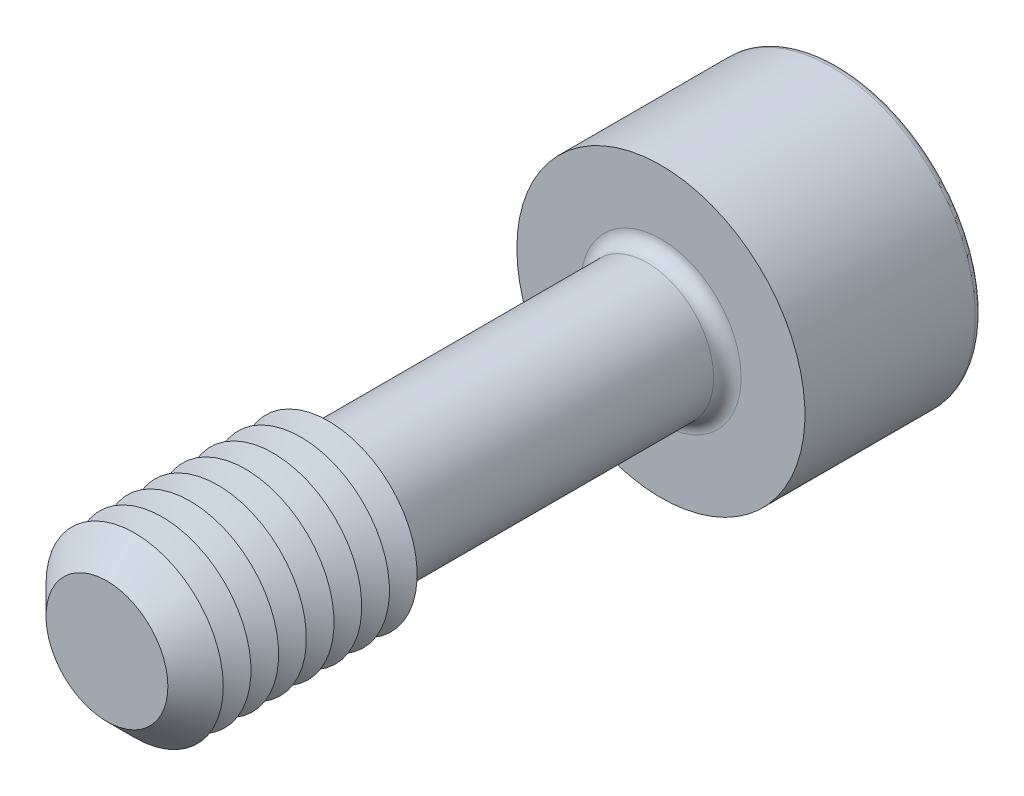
ISO-10303-21;
HEADER;
FILE_DESCRIPTION(('STEP AP214'),'2;1');
FILE_NAME('part.step','',(''),(''),'','','');
FILE_SCHEMA(('AUTOMOTIVE_DESIGN { 1 0 10303 214 1 1 1 1 }'));
ENDSEC;
DATA;
#1=APPLICATION_CONTEXT('core data for automotive mechanical design processes');
#2=APPLICATION_PROTOCOL_DEFINITION('international standard','automotive_design',2000,#1);
#3=PRODUCT_CONTEXT('',#1,'mechanical');
#4=PRODUCT('Part','Part','',(#3));
#5=PRODUCT_RELATED_PRODUCT_CATEGORY('part','',(#4));
#6=PRODUCT_DEFINITION_FORMATION('','',#4);
#7=PRODUCT_DEFINITION_CONTEXT('part definition',#1,'design');
#8=PRODUCT_DEFINITION('design','',#6,#7);
#9=PRODUCT_DEFINITION_SHAPE('','',#8);
#10=(LENGTH_UNIT() NAMED_UNIT(*) SI_UNIT(.MILLI.,.METRE.));
#11=(NAMED_UNIT(*) PLANE_ANGLE_UNIT() SI_UNIT($,.RADIAN.));
#12=(NAMED_UNIT(*) SI_UNIT($,.STERADIAN.) SOLID_ANGLE_UNIT());
#13=UNCERTAINTY_MEASURE_WITH_UNIT(LENGTH_MEASURE(1.E-05),#10,'distance_accuracy_value','');
#14=(GEOMETRIC_REPRESENTATION_CONTEXT(3) GLOBAL_UNCERTAINTY_ASSIGNED_CONTEXT((#13)) GLOBAL_UNIT_ASSIGNED_CONTEXT((#10,
#11,#12)) REPRESENTATION_CONTEXT('',''));
#15=CARTESIAN_POINT('',(0.,0.,0.));
#16=DIRECTION('',(0.,0.,1.));
#17=DIRECTION('',(1.,0.,0.));
#18=AXIS2_PLACEMENT_3D('',#15,#16,#17);
#19=CARTESIAN_POINT('',(-1.73205080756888,-3.,-14.5));
#20=DIRECTION('',(0.,0.,1.));
#21=DIRECTION('',(1.,0.,0.));
#22=AXIS2_PLACEMENT_3D('',#19,#20,#21);
#23=PLANE('',#22);
#24=DIRECTION('',(1.,0.,0.));
#25=VECTOR('',#24,1.);
#26=CARTESIAN_POINT('',(-1.73205080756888,-3.,-14.5));
#27=LINE('',#26,#25);
#28=CARTESIAN_POINT('',(0.,-3.,-14.5));
#29=VERTEX_POINT('',#28);
#30=CARTESIAN_POINT('',(1.73205080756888,-3.,-14.5));
#31=VERTEX_POINT('',#30);
#32=EDGE_CURVE('E405',#29,#31,#27,.T.);
#33=ORIENTED_EDGE('',*,*,#32,.F.);
#34=CARTESIAN_POINT('',(0.,0.,-14.5));
#35=DIRECTION('',(0.,0.,1.));
#36=DIRECTION('',(0.,-1.,0.));
#37=AXIS2_PLACEMENT_3D('',#34,#35,#36);
#38=CIRCLE('',#37,3.);
#39=CARTESIAN_POINT('',(2.59807621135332,-1.5,-14.5));
#40=VERTEX_POINT('',#39);
#41=EDGE_CURVE('E53',#29,#40,#38,.T.);
#42=ORIENTED_EDGE('',*,*,#41,.T.);
#43=DIRECTION('',(0.5,0.866025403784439,0.));
#44=VECTOR('',#43,1.);
#45=CARTESIAN_POINT('',(1.73205080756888,-3.,-14.5));
#46=LINE('',#45,#44);
#47=EDGE_CURVE('E394',#31,#40,#46,.T.);
#48=ORIENTED_EDGE('',*,*,#47,.F.);
#49=EDGE_LOOP('',(#33,#42,#48));
#50=FACE_BOUND('',#49,.T.);
#51=ADVANCED_FACE('F41',(#50),#23,.F.);
#52=CARTESIAN_POINT('',(3.46410161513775,0.,-14.5));
#53=VERTEX_POINT('',#52);
#54=EDGE_CURVE('E399',#40,#53,#46,.T.);
#55=ORIENTED_EDGE('',*,*,#54,.F.);
#56=CARTESIAN_POINT('',(2.59807621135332,1.5,-14.5));
#57=VERTEX_POINT('',#56);
#58=EDGE_CURVE('E11',#40,#57,#38,.T.);
#59=ORIENTED_EDGE('',*,*,#58,.T.);
#60=DIRECTION('',(-0.5,0.866025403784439,0.));
#61=VECTOR('',#60,1.);
#62=CARTESIAN_POINT('',(3.46410161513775,0.,-14.5));
#63=LINE('',#62,#61);
#64=EDGE_CURVE('E391',#53,#57,#63,.T.);
#65=ORIENTED_EDGE('',*,*,#64,.F.);
#66=EDGE_LOOP('',(#55,#59,#65));
#67=FACE_BOUND('',#66,.T.);
#68=ADVANCED_FACE('F133',(#67),#23,.F.);
#69=CARTESIAN_POINT('',(1.73205080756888,3.,-14.5));
#70=VERTEX_POINT('',#69);
#71=EDGE_CURVE('E390',#57,#70,#63,.T.);
#72=ORIENTED_EDGE('',*,*,#71,.F.);
#73=CARTESIAN_POINT('',(0.,3.,-14.5));
#74=VERTEX_POINT('',#73);
#75=EDGE_CURVE('E51',#57,#74,#38,.T.);
#76=ORIENTED_EDGE('',*,*,#75,.T.);
#77=DIRECTION('',(-1.,0.,0.));
#78=VECTOR('',#77,1.);
#79=CARTESIAN_POINT('',(1.73205080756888,3.,-14.5));
#80=LINE('',#79,#78);
#81=EDGE_CURVE('E177',#70,#74,#80,.T.);
#82=ORIENTED_EDGE('',*,*,#81,.F.);
#83=EDGE_LOOP('',(#72,#76,#82));
#84=FACE_BOUND('',#83,.T.);
#85=ADVANCED_FACE('F139',(#84),#23,.F.);
#86=CARTESIAN_POINT('',(-1.73205080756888,3.,-14.5));
#87=VERTEX_POINT('',#86);
#88=EDGE_CURVE('E396',#74,#87,#80,.T.);
#89=ORIENTED_EDGE('',*,*,#88,.F.);
#90=CARTESIAN_POINT('',(-2.59807621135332,1.5,-14.5));
#91=VERTEX_POINT('',#90);
#92=EDGE_CURVE('E265',#74,#91,#38,.T.);
#93=ORIENTED_EDGE('',*,*,#92,.T.);
#94=DIRECTION('',(-0.5,-0.866025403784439,0.));
#95=VECTOR('',#94,1.);
#96=CARTESIAN_POINT('',(-1.73205080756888,3.,-14.5));
#97=LINE('',#96,#95);
#98=EDGE_CURVE('E176',#87,#91,#97,.T.);
#99=ORIENTED_EDGE('',*,*,#98,.F.);
#100=EDGE_LOOP('',(#89,#93,#99));
#101=FACE_BOUND('',#100,.T.);
#102=ADVANCED_FACE('F157',(#101),#23,.F.);
#103=CARTESIAN_POINT('',(-3.46410161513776,0.,-14.5));
#104=VERTEX_POINT('',#103);
#105=EDGE_CURVE('E170',#91,#104,#97,.T.);
#106=ORIENTED_EDGE('',*,*,#105,.F.);
#107=CARTESIAN_POINT('',(-2.59807621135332,-1.5,-14.5));
#108=VERTEX_POINT('',#107);
#109=EDGE_CURVE('E172',#91,#108,#38,.T.);
#110=ORIENTED_EDGE('',*,*,#109,.T.);
#111=DIRECTION('',(0.5,-0.866025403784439,0.));
#112=VECTOR('',#111,1.);
#113=CARTESIAN_POINT('',(-3.46410161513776,0.,-14.5));
#114=LINE('',#113,#112);
#115=EDGE_CURVE('E174',#104,#108,#114,.T.);
#116=ORIENTED_EDGE('',*,*,#115,.F.);
#117=EDGE_LOOP('',(#106,#110,#116));
#118=FACE_BOUND('',#117,.T.);
#119=ADVANCED_FACE('F146',(#118),#23,.F.);
#120=CARTESIAN_POINT('',(0.,0.,-20.5));
#121=DIRECTION('',(0.,0.,-1.));
#122=DIRECTION('',(-1.,0.,0.));
#123=AXIS2_PLACEMENT_3D('',#120,#121,#122);
#124=PLANE('',#123);
#125=CARTESIAN_POINT('',(0.,0.,-20.5));
#126=DIRECTION('',(0.,0.,-1.));
#127=DIRECTION('',(-1.,0.,0.));
#128=AXIS2_PLACEMENT_3D('',#125,#126,#127);
#129=CIRCLE('',#128,6.19);
#130=CARTESIAN_POINT('',(-6.19,0.,-20.5));
#131=VERTEX_POINT('',#130);
#132=EDGE_CURVE('E250',#131,#131,#129,.T.);
#133=ORIENTED_EDGE('',*,*,#132,.T.);
#134=EDGE_LOOP('',(#133));
#135=FACE_BOUND('',#134,.T.);
#136=DIRECTION('',(-0.5,-0.866025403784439,0.));
#137=VECTOR('',#136,1.);
#138=CARTESIAN_POINT('',(-1.73205080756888,3.,-20.5));
#139=LINE('',#138,#137);
#140=CARTESIAN_POINT('',(-1.73205080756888,3.,-20.5));
#141=VERTEX_POINT('',#140);
#142=CARTESIAN_POINT('',(-3.46410161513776,0.,-20.5));
#143=VERTEX_POINT('',#142);
#144=EDGE_CURVE('E212',#141,#143,#139,.T.);
#145=ORIENTED_EDGE('',*,*,#144,.T.);
#146=DIRECTION('',(0.5,-0.866025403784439,0.));
#147=VECTOR('',#146,1.);
#148=CARTESIAN_POINT('',(-3.46410161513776,0.,-20.5));
#149=LINE('',#148,#147);
#150=CARTESIAN_POINT('',(-1.73205080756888,-3.,-20.5));
#151=VERTEX_POINT('',#150);
#152=EDGE_CURVE('E67',#143,#151,#149,.T.);
#153=ORIENTED_EDGE('',*,*,#152,.T.);
#154=DIRECTION('',(1.,0.,0.));
#155=VECTOR('',#154,1.);
#156=CARTESIAN_POINT('',(-1.73205080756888,-3.,-20.5));
#157=LINE('',#156,#155);
#158=CARTESIAN_POINT('',(1.73205080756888,-3.,-20.5));
#159=VERTEX_POINT('',#158);
#160=EDGE_CURVE('E196',#151,#159,#157,.T.);
#161=ORIENTED_EDGE('',*,*,#160,.T.);
#162=DIRECTION('',(0.5,0.866025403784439,0.));
#163=VECTOR('',#162,1.);
#164=CARTESIAN_POINT('',(1.73205080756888,-3.,-20.5));
#165=LINE('',#164,#163);
#166=CARTESIAN_POINT('',(3.46410161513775,0.,-20.5));
#167=VERTEX_POINT('',#166);
#168=EDGE_CURVE('E200',#159,#167,#165,.T.);
#169=ORIENTED_EDGE('',*,*,#168,.T.);
#170=DIRECTION('',(-0.5,0.866025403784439,0.));
#171=VECTOR('',#170,1.);
#172=CARTESIAN_POINT('',(3.46410161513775,0.,-20.5));
#173=LINE('',#172,#171);
#174=CARTESIAN_POINT('',(1.73205080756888,3.,-20.5));
#175=VERTEX_POINT('',#174);
#176=EDGE_CURVE('E204',#167,#175,#173,.T.);
#177=ORIENTED_EDGE('',*,*,#176,.T.);
#178=DIRECTION('',(-1.,0.,0.));
#179=VECTOR('',#178,1.);
#180=CARTESIAN_POINT('',(1.73205080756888,3.,-20.5));
#181=LINE('',#180,#179);
#182=EDGE_CURVE('E208',#175,#141,#181,.T.);
#183=ORIENTED_EDGE('',*,*,#182,.T.);
#184=EDGE_LOOP('',(#145,#153,#161,#169,#177,#183));
#185=FACE_BOUND('',#184,.T.);
#186=ADVANCED_FACE('F156',(#135,#185),#124,.T.);
#187=CARTESIAN_POINT('',(0.,0.,12.5));
#188=DIRECTION('',(0.,0.,-1.));
#189=DIRECTION('',(-1.,0.,0.));
#190=AXIS2_PLACEMENT_3D('',#187,#188,#189);
#191=CYLINDRICAL_SURFACE('',#190,3.);
#192=CARTESIAN_POINT('',(0.,0.,-11.88));
#193=DIRECTION('',(0.,0.,-1.));
#194=DIRECTION('',(-1.,0.,0.));
#195=AXIS2_PLACEMENT_3D('',#192,#193,#194);
#196=CIRCLE('',#195,3.);
#197=CARTESIAN_POINT('',(-3.,0.,-11.88));
#198=VERTEX_POINT('',#197);
#199=EDGE_CURVE('E247',#198,#198,#196,.F.);
#200=ORIENTED_EDGE('',*,*,#199,.T.);
#201=EDGE_LOOP('',(#200));
#202=FACE_BOUND('',#201,.T.);
#203=CARTESIAN_POINT('',(0.,0.,1.92264973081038));
#204=DIRECTION('',(0.,0.,-1.));
#205=DIRECTION('',(0.,1.,0.));
#206=AXIS2_PLACEMENT_3D('',#203,#204,#205);
#207=CIRCLE('',#206,3.);
#208=CARTESIAN_POINT('',(0.,3.,1.92264973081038));
#209=VERTEX_POINT('',#208);
#210=EDGE_CURVE('E235',#209,#209,#207,.T.);
#211=ORIENTED_EDGE('',*,*,#210,.T.);
#212=EDGE_LOOP('',(#211));
#213=FACE_BOUND('',#212,.T.);
#214=ADVANCED_FACE('F163',(#202,#213),#191,.T.);
#215=CARTESIAN_POINT('',(0.,0.,1.92264973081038));
#216=DIRECTION('',(0.,0.,1.));
#217=DIRECTION('',(0.,-1.,0.));
#218=AXIS2_PLACEMENT_3D('',#215,#216,#217);
#219=CONICAL_SURFACE('',#218,3.,1.0471975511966);
#220=CARTESIAN_POINT('',(0.,0.,2.5));
#221=DIRECTION('',(0.,0.,-1.));
#222=DIRECTION('',(-1.,0.,0.));
#223=AXIS2_PLACEMENT_3D('',#220,#221,#222);
#224=CIRCLE('',#223,4.);
#225=CARTESIAN_POINT('',(-4.,0.,2.5));
#226=VERTEX_POINT('',#225);
#227=EDGE_CURVE('E269',#226,#226,#224,.T.);
#228=ORIENTED_EDGE('',*,*,#227,.T.);
#229=EDGE_LOOP('',(#228));
#230=FACE_BOUND('',#229,.T.);
#231=ORIENTED_EDGE('',*,*,#210,.F.);
#232=EDGE_LOOP('',(#231));
#233=FACE_BOUND('',#232,.T.);
#234=ADVANCED_FACE('F348',(#230,#233),#219,.T.);
#235=CARTESIAN_POINT('',(0.,0.,-12.5));
#236=DIRECTION('',(0.,0.,-1.));
#237=DIRECTION('',(-1.,0.,0.));
#238=AXIS2_PLACEMENT_3D('',#235,#236,#237);
#239=PLANE('',#238);
#240=CARTESIAN_POINT('',(0.,0.,-12.5));
#241=DIRECTION('',(0.,0.,-1.));
#242=DIRECTION('',(-1.,0.,0.));
#243=AXIS2_PLACEMENT_3D('',#240,#241,#242);
#244=CIRCLE('',#243,3.62);
#245=CARTESIAN_POINT('',(-3.62,0.,-12.5));
#246=VERTEX_POINT('',#245);
#247=EDGE_CURVE('E243',#246,#246,#244,.T.);
#248=ORIENTED_EDGE('',*,*,#247,.T.);
#249=EDGE_LOOP('',(#248));
#250=FACE_BOUND('',#249,.T.);
#251=CARTESIAN_POINT('',(0.,0.,-12.5));
#252=DIRECTION('',(0.,0.,-1.));
#253=DIRECTION('',(-1.,0.,0.));
#254=AXIS2_PLACEMENT_3D('',#251,#252,#253);
#255=CIRCLE('',#254,6.5);
#256=CARTESIAN_POINT('',(-6.5,0.,-12.5));
#257=VERTEX_POINT('',#256);
#258=EDGE_CURVE('E231',#257,#257,#255,.T.);
#259=ORIENTED_EDGE('',*,*,#258,.F.);
#260=EDGE_LOOP('',(#259));
#261=FACE_BOUND('',#260,.T.);
#262=ADVANCED_FACE('F353',(#250,#261),#239,.F.);
#263=CARTESIAN_POINT('',(0.,0.,-20.5));
#264=DIRECTION('',(0.,0.,1.));
#265=DIRECTION('',(1.,0.,0.));
#266=AXIS2_PLACEMENT_3D('',#263,#264,#265);
#267=CYLINDRICAL_SURFACE('',#266,6.5);
#268=CARTESIAN_POINT('',(0.,0.,-20.19));
#269=DIRECTION('',(0.,0.,-1.));
#270=DIRECTION('',(-1.,0.,0.));
#271=AXIS2_PLACEMENT_3D('',#268,#269,#270);
#272=CIRCLE('',#271,6.5);
#273=CARTESIAN_POINT('',(-6.5,0.,-20.19));
#274=VERTEX_POINT('',#273);
#275=EDGE_CURVE('E45',#274,#274,#272,.F.);
#276=ORIENTED_EDGE('',*,*,#275,.T.);
#277=EDGE_LOOP('',(#276));
#278=FACE_BOUND('',#277,.T.);
#279=ORIENTED_EDGE('',*,*,#258,.T.);
#280=EDGE_LOOP('',(#279));
#281=FACE_BOUND('',#280,.T.);
#282=ADVANCED_FACE('F354',(#278,#281),#267,.T.);
#283=CARTESIAN_POINT('',(-3.46410161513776,0.,-14.5));
#284=DIRECTION('',(0.866025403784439,0.5,0.));
#285=DIRECTION('',(-0.5,0.866025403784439,0.));
#286=AXIS2_PLACEMENT_3D('',#283,#284,#285);
#287=PLANE('',#286);
#288=ORIENTED_EDGE('',*,*,#152,.F.);
#289=DIRECTION('',(0.,0.,-1.));
#290=VECTOR('',#289,1.);
#291=CARTESIAN_POINT('',(-3.46410161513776,0.,-14.5));
#292=LINE('',#291,#290);
#293=EDGE_CURVE('E186',#104,#143,#292,.T.);
#294=ORIENTED_EDGE('',*,*,#293,.F.);
#295=ORIENTED_EDGE('',*,*,#115,.T.);
#296=CARTESIAN_POINT('',(-1.73205080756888,-3.,-14.5));
#297=VERTEX_POINT('',#296);
#298=EDGE_CURVE('E215',#108,#297,#114,.T.);
#299=ORIENTED_EDGE('',*,*,#298,.T.);
#300=DIRECTION('',(0.,0.,-1.));
#301=VECTOR('',#300,1.);
#302=CARTESIAN_POINT('',(-1.73205080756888,-3.,-14.5));
#303=LINE('',#302,#301);
#304=EDGE_CURVE('E228',#297,#151,#303,.T.);
#305=ORIENTED_EDGE('',*,*,#304,.T.);
#306=EDGE_LOOP('',(#288,#294,#295,#299,#305));
#307=FACE_BOUND('',#306,.T.);
#308=ADVANCED_FACE('F357',(#307),#287,.T.);
#309=CARTESIAN_POINT('',(-1.73205080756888,-3.,-14.5));
#310=DIRECTION('',(0.,1.,0.));
#311=DIRECTION('',(0.,0.,1.));
#312=AXIS2_PLACEMENT_3D('',#309,#310,#311);
#313=PLANE('',#312);
#314=ORIENTED_EDGE('',*,*,#160,.F.);
#315=ORIENTED_EDGE('',*,*,#304,.F.);
#316=EDGE_CURVE('E402',#297,#29,#27,.T.);
#317=ORIENTED_EDGE('',*,*,#316,.T.);
#318=ORIENTED_EDGE('',*,*,#32,.T.);
#319=DIRECTION('',(0.,0.,-1.));
#320=VECTOR('',#319,1.);
#321=CARTESIAN_POINT('',(1.73205080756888,-3.,-14.5));
#322=LINE('',#321,#320);
#323=EDGE_CURVE('E225',#31,#159,#322,.T.);
#324=ORIENTED_EDGE('',*,*,#323,.T.);
#325=EDGE_LOOP('',(#314,#315,#317,#318,#324));
#326=FACE_BOUND('',#325,.T.);
#327=ADVANCED_FACE('F363',(#326),#313,.T.);
#328=CARTESIAN_POINT('',(1.73205080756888,-3.,-14.5));
#329=DIRECTION('',(-0.866025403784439,0.5,0.));
#330=DIRECTION('',(-0.5,-0.866025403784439,0.));
#331=AXIS2_PLACEMENT_3D('',#328,#329,#330);
#332=PLANE('',#331);
#333=ORIENTED_EDGE('',*,*,#168,.F.);
#334=ORIENTED_EDGE('',*,*,#323,.F.);
#335=ORIENTED_EDGE('',*,*,#47,.T.);
#336=ORIENTED_EDGE('',*,*,#54,.T.);
#337=DIRECTION('',(0.,0.,-1.));
#338=VECTOR('',#337,1.);
#339=CARTESIAN_POINT('',(3.46410161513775,0.,-14.5));
#340=LINE('',#339,#338);
#341=EDGE_CURVE('E222',#53,#167,#340,.T.);
#342=ORIENTED_EDGE('',*,*,#341,.T.);
#343=EDGE_LOOP('',(#333,#334,#335,#336,#342));
#344=FACE_BOUND('',#343,.T.);
#345=ADVANCED_FACE('F366',(#344),#332,.T.);
#346=CARTESIAN_POINT('',(3.46410161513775,0.,-14.5));
#347=DIRECTION('',(-0.866025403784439,-0.5,0.));
#348=DIRECTION('',(0.5,-0.866025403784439,0.));
#349=AXIS2_PLACEMENT_3D('',#346,#347,#348);
#350=PLANE('',#349);
#351=ORIENTED_EDGE('',*,*,#176,.F.);
#352=ORIENTED_EDGE('',*,*,#341,.F.);
#353=ORIENTED_EDGE('',*,*,#64,.T.);
#354=ORIENTED_EDGE('',*,*,#71,.T.);
#355=DIRECTION('',(0.,0.,-1.));
#356=VECTOR('',#355,1.);
#357=CARTESIAN_POINT('',(1.73205080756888,3.,-14.5));
#358=LINE('',#357,#356);
#359=EDGE_CURVE('E219',#70,#175,#358,.T.);
#360=ORIENTED_EDGE('',*,*,#359,.T.);
#361=EDGE_LOOP('',(#351,#352,#353,#354,#360));
#362=FACE_BOUND('',#361,.T.);
#363=ADVANCED_FACE('F370',(#362),#350,.T.);
#364=CARTESIAN_POINT('',(1.73205080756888,3.,-14.5));
#365=DIRECTION('',(0.,-1.,0.));
#366=DIRECTION('',(1.,0.,0.));
#367=AXIS2_PLACEMENT_3D('',#364,#365,#366);
#368=PLANE('',#367);
#369=ORIENTED_EDGE('',*,*,#182,.F.);
#370=ORIENTED_EDGE('',*,*,#359,.F.);
#371=ORIENTED_EDGE('',*,*,#81,.T.);
#372=ORIENTED_EDGE('',*,*,#88,.T.);
#373=DIRECTION('',(0.,0.,-1.));
#374=VECTOR('',#373,1.);
#375=CARTESIAN_POINT('',(-1.73205080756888,3.,-14.5));
#376=LINE('',#375,#374);
#377=EDGE_CURVE('E182',#87,#141,#376,.T.);
#378=ORIENTED_EDGE('',*,*,#377,.T.);
#379=EDGE_LOOP('',(#369,#370,#371,#372,#378));
#380=FACE_BOUND('',#379,.T.);
#381=ADVANCED_FACE('F152',(#380),#368,.T.);
#382=CARTESIAN_POINT('',(-1.73205080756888,3.,-14.5));
#383=DIRECTION('',(0.866025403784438,-0.5,0.));
#384=DIRECTION('',(0.5,0.866025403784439,0.));
#385=AXIS2_PLACEMENT_3D('',#382,#383,#384);
#386=PLANE('',#385);
#387=ORIENTED_EDGE('',*,*,#144,.F.);
#388=ORIENTED_EDGE('',*,*,#377,.F.);
#389=ORIENTED_EDGE('',*,*,#98,.T.);
#390=ORIENTED_EDGE('',*,*,#105,.T.);
#391=ORIENTED_EDGE('',*,*,#293,.T.);
#392=EDGE_LOOP('',(#387,#388,#389,#390,#391));
#393=FACE_BOUND('',#392,.T.);
#394=ADVANCED_FACE('F144',(#393),#386,.T.);
#395=ORIENTED_EDGE('',*,*,#298,.F.);
#396=EDGE_CURVE('E257',#108,#29,#38,.T.);
#397=ORIENTED_EDGE('',*,*,#396,.T.);
#398=ORIENTED_EDGE('',*,*,#316,.F.);
#399=EDGE_LOOP('',(#395,#397,#398));
#400=FACE_BOUND('',#399,.T.);
#401=ADVANCED_FACE('F135',(#400),#23,.F.);
#402=CARTESIAN_POINT('',(0.,0.,-11.88));
#403=DIRECTION('',(0.,0.,-1.));
#404=DIRECTION('',(-1.,0.,0.));
#405=AXIS2_PLACEMENT_3D('',#402,#403,#404);
#406=TOROIDAL_SURFACE('',#405,3.62,0.62);
#407=ORIENTED_EDGE('',*,*,#199,.F.);
#408=EDGE_LOOP('',(#407));
#409=FACE_BOUND('',#408,.T.);
#410=ORIENTED_EDGE('',*,*,#247,.F.);
#411=EDGE_LOOP('',(#410));
#412=FACE_BOUND('',#411,.T.);
#413=ADVANCED_FACE('F129',(#409,#412),#406,.F.);
#414=CARTESIAN_POINT('',(0.,0.,-20.19));
#415=DIRECTION('',(0.,0.,-1.));
#416=DIRECTION('',(-1.,0.,0.));
#417=AXIS2_PLACEMENT_3D('',#414,#415,#416);
#418=TOROIDAL_SURFACE('',#417,6.19,0.31);
#419=ORIENTED_EDGE('',*,*,#275,.F.);
#420=EDGE_LOOP('',(#419));
#421=FACE_BOUND('',#420,.T.);
#422=ORIENTED_EDGE('',*,*,#132,.F.);
#423=EDGE_LOOP('',(#422));
#424=FACE_BOUND('',#423,.T.);
#425=ADVANCED_FACE('F43',(#421,#424),#418,.T.);
#426=CARTESIAN_POINT('',(0.,0.,-12.7679491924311));
#427=DIRECTION('',(0.,0.,-1.));
#428=DIRECTION('',(0.,1.,0.));
#429=AXIS2_PLACEMENT_3D('',#426,#427,#428);
#430=CONICAL_SURFACE('',#429,0.,1.0471975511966);
#431=ORIENTED_EDGE('',*,*,#41,.F.);
#432=ORIENTED_EDGE('',*,*,#396,.F.);
#433=ORIENTED_EDGE('',*,*,#109,.F.);
#434=ORIENTED_EDGE('',*,*,#92,.F.);
#435=ORIENTED_EDGE('',*,*,#75,.F.);
#436=ORIENTED_EDGE('',*,*,#58,.F.);
#437=EDGE_LOOP('',(#431,#432,#433,#434,#435,#436));
#438=FACE_BOUND('',#437,.T.);
#439=CARTESIAN_POINT('',(0.,0.,-12.7679491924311));
#440=VERTEX_POINT('',#439);
#441=VERTEX_LOOP('',#440);
#442=FACE_BOUND('',#441,.T.);
#443=ADVANCED_FACE('F118',(#438,#442),#430,.F.);
#444=CARTESIAN_POINT('',(0.,0.,3.125));
#445=DIRECTION('',(0.,0.,-1.));
#446=DIRECTION('',(-1.,0.,0.));
#447=AXIS2_PLACEMENT_3D('',#444,#445,#446);
#448=CONICAL_SURFACE('',#447,2.91746824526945,1.0471975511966);
#449=ORIENTED_EDGE('',*,*,#227,.F.);
#450=EDGE_LOOP('',(#449));
#451=FACE_BOUND('',#450,.T.);
#452=CARTESIAN_POINT('',(0.,0.,3.125));
#453=DIRECTION('',(0.,0.,-1.));
#454=DIRECTION('',(-1.,0.,0.));
#455=AXIS2_PLACEMENT_3D('',#452,#453,#454);
#456=CIRCLE('',#455,2.91746824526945);
#457=CARTESIAN_POINT('',(-2.91746824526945,0.,3.125));
#458=VERTEX_POINT('',#457);
#459=EDGE_CURVE('E276',#458,#458,#456,.T.);
#460=ORIENTED_EDGE('',*,*,#459,.T.);
#461=EDGE_LOOP('',(#460));
#462=FACE_BOUND('',#461,.T.);
#463=ADVANCED_FACE('F120',(#451,#462),#448,.T.);
#464=CARTESIAN_POINT('',(0.,0.,3.75));
#465=DIRECTION('',(0.,0.,1.));
#466=DIRECTION('',(1.,0.,0.));
#467=AXIS2_PLACEMENT_3D('',#464,#465,#466);
#468=CONICAL_SURFACE('',#467,4.,1.0471975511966);
#469=ORIENTED_EDGE('',*,*,#459,.F.);
#470=EDGE_LOOP('',(#469));
#471=FACE_BOUND('',#470,.T.);
#472=CARTESIAN_POINT('',(0.,0.,3.75));
#473=DIRECTION('',(0.,0.,-1.));
#474=DIRECTION('',(-1.,0.,0.));
#475=AXIS2_PLACEMENT_3D('',#472,#473,#474);
#476=CIRCLE('',#475,4.);
#477=CARTESIAN_POINT('',(-4.,0.,3.75));
#478=VERTEX_POINT('',#477);
#479=EDGE_CURVE('E282',#478,#478,#476,.T.);
#480=ORIENTED_EDGE('',*,*,#479,.T.);
#481=EDGE_LOOP('',(#480));
#482=FACE_BOUND('',#481,.T.);
#483=ADVANCED_FACE('F126',(#471,#482),#468,.T.);
#484=CARTESIAN_POINT('',(0.,0.,4.375));
#485=DIRECTION('',(0.,0.,-1.));
#486=DIRECTION('',(-1.,0.,0.));
#487=AXIS2_PLACEMENT_3D('',#484,#485,#486);
#488=CONICAL_SURFACE('',#487,2.91746824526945,1.0471975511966);
#489=ORIENTED_EDGE('',*,*,#479,.F.);
#490=EDGE_LOOP('',(#489));
#491=FACE_BOUND('',#490,.T.);
#492=CARTESIAN_POINT('',(0.,0.,4.375));
#493=DIRECTION('',(0.,0.,-1.));
#494=DIRECTION('',(-1.,0.,0.));
#495=AXIS2_PLACEMENT_3D('',#492,#493,#494);
#496=CIRCLE('',#495,2.91746824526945);
#497=CARTESIAN_POINT('',(-2.91746824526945,0.,4.375));
#498=VERTEX_POINT('',#497);
#499=EDGE_CURVE('E288',#498,#498,#496,.T.);
#500=ORIENTED_EDGE('',*,*,#499,.T.);
#501=EDGE_LOOP('',(#500));
#502=FACE_BOUND('',#501,.T.);
#503=ADVANCED_FACE('F508',(#491,#502),#488,.T.);
#504=CARTESIAN_POINT('',(0.,0.,5.));
#505=DIRECTION('',(0.,0.,1.));
#506=DIRECTION('',(1.,0.,0.));
#507=AXIS2_PLACEMENT_3D('',#504,#505,#506);
#508=CONICAL_SURFACE('',#507,4.,1.0471975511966);
#509=ORIENTED_EDGE('',*,*,#499,.F.);
#510=EDGE_LOOP('',(#509));
#511=FACE_BOUND('',#510,.T.);
#512=CARTESIAN_POINT('',(0.,0.,5.));
#513=DIRECTION('',(0.,0.,-1.));
#514=DIRECTION('',(-1.,0.,0.));
#515=AXIS2_PLACEMENT_3D('',#512,#513,#514);
#516=CIRCLE('',#515,4.);
#517=CARTESIAN_POINT('',(-4.,0.,5.));
#518=VERTEX_POINT('',#517);
#519=EDGE_CURVE('E291',#518,#518,#516,.T.);
#520=ORIENTED_EDGE('',*,*,#519,.T.);
#521=EDGE_LOOP('',(#520));
#522=FACE_BOUND('',#521,.T.);
#523=ADVANCED_FACE('F517',(#511,#522),#508,.T.);
#524=CARTESIAN_POINT('',(0.,0.,5.625));
#525=DIRECTION('',(0.,0.,-1.));
#526=DIRECTION('',(-1.,0.,0.));
#527=AXIS2_PLACEMENT_3D('',#524,#525,#526);
#528=CONICAL_SURFACE('',#527,2.91746824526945,1.0471975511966);
#529=ORIENTED_EDGE('',*,*,#519,.F.);
#530=EDGE_LOOP('',(#529));
#531=FACE_BOUND('',#530,.T.);
#532=CARTESIAN_POINT('',(0.,0.,5.625));
#533=DIRECTION('',(0.,0.,-1.));
#534=DIRECTION('',(-1.,0.,0.));
#535=AXIS2_PLACEMENT_3D('',#532,#533,#534);
#536=CIRCLE('',#535,2.91746824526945);
#537=CARTESIAN_POINT('',(-2.91746824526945,0.,5.625));
#538=VERTEX_POINT('',#537);
#539=EDGE_CURVE('E294',#538,#538,#536,.T.);
#540=ORIENTED_EDGE('',*,*,#539,.T.);
#541=EDGE_LOOP('',(#540));
#542=FACE_BOUND('',#541,.T.);
#543=ADVANCED_FACE('F526',(#531,#542),#528,.T.);
#544=CARTESIAN_POINT('',(0.,0.,6.25));
#545=DIRECTION('',(0.,0.,1.));
#546=DIRECTION('',(1.,0.,0.));
#547=AXIS2_PLACEMENT_3D('',#544,#545,#546);
#548=CONICAL_SURFACE('',#547,4.,1.0471975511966);
#549=ORIENTED_EDGE('',*,*,#539,.F.);
#550=EDGE_LOOP('',(#549));
#551=FACE_BOUND('',#550,.T.);
#552=CARTESIAN_POINT('',(0.,0.,6.25));
#553=DIRECTION('',(0.,0.,-1.));
#554=DIRECTION('',(-1.,0.,0.));
#555=AXIS2_PLACEMENT_3D('',#552,#553,#554);
#556=CIRCLE('',#555,4.);
#557=CARTESIAN_POINT('',(-4.,0.,6.25));
#558=VERTEX_POINT('',#557);
#559=EDGE_CURVE('E298',#558,#558,#556,.T.);
#560=ORIENTED_EDGE('',*,*,#559,.T.);
#561=EDGE_LOOP('',(#560));
#562=FACE_BOUND('',#561,.T.);
#563=ADVANCED_FACE('F535',(#551,#562),#548,.T.);
#564=CARTESIAN_POINT('',(0.,0.,6.875));
#565=DIRECTION('',(0.,0.,-1.));
#566=DIRECTION('',(-1.,0.,0.));
#567=AXIS2_PLACEMENT_3D('',#564,#565,#566);
#568=CONICAL_SURFACE('',#567,2.91746824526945,1.0471975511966);
#569=ORIENTED_EDGE('',*,*,#559,.F.);
#570=EDGE_LOOP('',(#569));
#571=FACE_BOUND('',#570,.T.);
#572=CARTESIAN_POINT('',(0.,0.,6.875));
#573=DIRECTION('',(0.,0.,-1.));
#574=DIRECTION('',(-1.,0.,0.));
#575=AXIS2_PLACEMENT_3D('',#572,#573,#574);
#576=CIRCLE('',#575,2.91746824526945);
#577=CARTESIAN_POINT('',(-2.91746824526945,0.,6.875));
#578=VERTEX_POINT('',#577);
#579=EDGE_CURVE('E302',#578,#578,#576,.T.);
#580=ORIENTED_EDGE('',*,*,#579,.T.);
#581=EDGE_LOOP('',(#580));
#582=FACE_BOUND('',#581,.T.);
#583=ADVANCED_FACE('F544',(#571,#582),#568,.T.);
#584=CARTESIAN_POINT('',(0.,0.,7.5));
#585=DIRECTION('',(0.,0.,1.));
#586=DIRECTION('',(1.,0.,0.));
#587=AXIS2_PLACEMENT_3D('',#584,#585,#586);
#588=CONICAL_SURFACE('',#587,4.,1.0471975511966);
#589=ORIENTED_EDGE('',*,*,#579,.F.);
#590=EDGE_LOOP('',(#589));
#591=FACE_BOUND('',#590,.T.);
#592=CARTESIAN_POINT('',(0.,0.,7.5));
#593=DIRECTION('',(0.,0.,-1.));
#594=DIRECTION('',(-1.,0.,0.));
#595=AXIS2_PLACEMENT_3D('',#592,#593,#594);
#596=CIRCLE('',#595,4.);
#597=CARTESIAN_POINT('',(-4.,0.,7.5));
#598=VERTEX_POINT('',#597);
#599=EDGE_CURVE('E306',#598,#598,#596,.T.);
#600=ORIENTED_EDGE('',*,*,#599,.T.);
#601=EDGE_LOOP('',(#600));
#602=FACE_BOUND('',#601,.T.);
#603=ADVANCED_FACE('F553',(#591,#602),#588,.T.);
#604=CARTESIAN_POINT('',(0.,0.,8.125));
#605=DIRECTION('',(0.,0.,-1.));
#606=DIRECTION('',(-1.,0.,0.));
#607=AXIS2_PLACEMENT_3D('',#604,#605,#606);
#608=CONICAL_SURFACE('',#607,2.91746824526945,1.0471975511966);
#609=ORIENTED_EDGE('',*,*,#599,.F.);
#610=EDGE_LOOP('',(#609));
#611=FACE_BOUND('',#610,.T.);
#612=CARTESIAN_POINT('',(0.,0.,8.125));
#613=DIRECTION('',(0.,0.,-1.));
#614=DIRECTION('',(-1.,0.,0.));
#615=AXIS2_PLACEMENT_3D('',#612,#613,#614);
#616=CIRCLE('',#615,2.91746824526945);
#617=CARTESIAN_POINT('',(-2.91746824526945,0.,8.125));
#618=VERTEX_POINT('',#617);
#619=EDGE_CURVE('E309',#618,#618,#616,.T.);
#620=ORIENTED_EDGE('',*,*,#619,.T.);
#621=EDGE_LOOP('',(#620));
#622=FACE_BOUND('',#621,.T.);
#623=ADVANCED_FACE('F562',(#611,#622),#608,.T.);
#624=CARTESIAN_POINT('',(0.,0.,8.75));
#625=DIRECTION('',(0.,0.,1.));
#626=DIRECTION('',(1.,0.,0.));
#627=AXIS2_PLACEMENT_3D('',#624,#625,#626);
#628=CONICAL_SURFACE('',#627,4.,1.0471975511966);
#629=ORIENTED_EDGE('',*,*,#619,.F.);
#630=EDGE_LOOP('',(#629));
#631=FACE_BOUND('',#630,.T.);
#632=CARTESIAN_POINT('',(0.,0.,8.75));
#633=DIRECTION('',(0.,0.,-1.));
#634=DIRECTION('',(-1.,0.,0.));
#635=AXIS2_PLACEMENT_3D('',#632,#633,#634);
#636=CIRCLE('',#635,4.);
#637=CARTESIAN_POINT('',(-4.,0.,8.75));
#638=VERTEX_POINT('',#637);
#639=EDGE_CURVE('E313',#638,#638,#636,.T.);
#640=ORIENTED_EDGE('',*,*,#639,.T.);
#641=EDGE_LOOP('',(#640));
#642=FACE_BOUND('',#641,.T.);
#643=ADVANCED_FACE('F571',(#631,#642),#628,.T.);
#644=CARTESIAN_POINT('',(0.,0.,9.375));
#645=DIRECTION('',(0.,0.,-1.));
#646=DIRECTION('',(-1.,0.,0.));
#647=AXIS2_PLACEMENT_3D('',#644,#645,#646);
#648=CONICAL_SURFACE('',#647,2.91746824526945,1.0471975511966);
#649=ORIENTED_EDGE('',*,*,#639,.F.);
#650=EDGE_LOOP('',(#649));
#651=FACE_BOUND('',#650,.T.);
#652=CARTESIAN_POINT('',(0.,0.,9.375));
#653=DIRECTION('',(0.,0.,-1.));
#654=DIRECTION('',(-1.,0.,0.));
#655=AXIS2_PLACEMENT_3D('',#652,#653,#654);
#656=CIRCLE('',#655,2.91746824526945);
#657=CARTESIAN_POINT('',(-2.91746824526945,0.,9.375));
#658=VERTEX_POINT('',#657);
#659=EDGE_CURVE('E317',#658,#658,#656,.T.);
#660=ORIENTED_EDGE('',*,*,#659,.T.);
#661=EDGE_LOOP('',(#660));
#662=FACE_BOUND('',#661,.T.);
#663=ADVANCED_FACE('F580',(#651,#662),#648,.T.);
#664=CARTESIAN_POINT('',(0.,0.,10.));
#665=DIRECTION('',(0.,0.,1.));
#666=DIRECTION('',(1.,0.,0.));
#667=AXIS2_PLACEMENT_3D('',#664,#665,#666);
#668=CONICAL_SURFACE('',#667,4.,1.0471975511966);
#669=ORIENTED_EDGE('',*,*,#659,.F.);
#670=EDGE_LOOP('',(#669));
#671=FACE_BOUND('',#670,.T.);
#672=CARTESIAN_POINT('',(0.,0.,10.));
#673=DIRECTION('',(0.,0.,-1.));
#674=DIRECTION('',(-1.,0.,0.));
#675=AXIS2_PLACEMENT_3D('',#672,#673,#674);
#676=CIRCLE('',#675,4.);
#677=CARTESIAN_POINT('',(-4.,0.,10.));
#678=VERTEX_POINT('',#677);
#679=EDGE_CURVE('E321',#678,#678,#676,.T.);
#680=ORIENTED_EDGE('',*,*,#679,.T.);
#681=EDGE_LOOP('',(#680));
#682=FACE_BOUND('',#681,.T.);
#683=ADVANCED_FACE('F589',(#671,#682),#668,.T.);
#684=CARTESIAN_POINT('',(0.,0.,10.625));
#685=DIRECTION('',(0.,0.,-1.));
#686=DIRECTION('',(-1.,0.,0.));
#687=AXIS2_PLACEMENT_3D('',#684,#685,#686);
#688=CONICAL_SURFACE('',#687,2.91746824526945,1.0471975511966);
#689=ORIENTED_EDGE('',*,*,#679,.F.);
#690=EDGE_LOOP('',(#689));
#691=FACE_BOUND('',#690,.T.);
#692=CARTESIAN_POINT('',(0.,0.,10.625));
#693=DIRECTION('',(0.,0.,-1.));
#694=DIRECTION('',(-1.,0.,0.));
#695=AXIS2_PLACEMENT_3D('',#692,#693,#694);
#696=CIRCLE('',#695,2.91746824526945);
#697=CARTESIAN_POINT('',(-2.91746824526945,0.,10.625));
#698=VERTEX_POINT('',#697);
#699=EDGE_CURVE('E325',#698,#698,#696,.T.);
#700=ORIENTED_EDGE('',*,*,#699,.T.);
#701=EDGE_LOOP('',(#700));
#702=FACE_BOUND('',#701,.T.);
#703=ADVANCED_FACE('F598',(#691,#702),#688,.T.);
#704=CARTESIAN_POINT('',(0.,0.,11.25));
#705=DIRECTION('',(0.,0.,1.));
#706=DIRECTION('',(1.,0.,0.));
#707=AXIS2_PLACEMENT_3D('',#704,#705,#706);
#708=CONICAL_SURFACE('',#707,4.,1.0471975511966);
#709=ORIENTED_EDGE('',*,*,#699,.F.);
#710=EDGE_LOOP('',(#709));
#711=FACE_BOUND('',#710,.T.);
#712=CARTESIAN_POINT('',(0.,0.,11.25));
#713=DIRECTION('',(0.,0.,-1.));
#714=DIRECTION('',(-1.,0.,0.));
#715=AXIS2_PLACEMENT_3D('',#712,#713,#714);
#716=CIRCLE('',#715,4.);
#717=CARTESIAN_POINT('',(-4.,0.,11.25));
#718=VERTEX_POINT('',#717);
#719=EDGE_CURVE('E329',#718,#718,#716,.T.);
#720=ORIENTED_EDGE('',*,*,#719,.T.);
#721=EDGE_LOOP('',(#720));
#722=FACE_BOUND('',#721,.T.);
#723=ADVANCED_FACE('F333',(#711,#722),#708,.T.);
#724=CARTESIAN_POINT('',(0.,0.,12.5));
#725=DIRECTION('',(0.,0.,1.));
#726=DIRECTION('',(1.,0.,0.));
#727=AXIS2_PLACEMENT_3D('',#724,#725,#726);
#728=PLANE('',#727);
#729=CARTESIAN_POINT('',(0.,0.,12.5));
#730=DIRECTION('',(0.,0.,1.));
#731=DIRECTION('',(1.,0.,0.));
#732=AXIS2_PLACEMENT_3D('',#729,#730,#731);
#733=CIRCLE('',#732,2.75);
#734=CARTESIAN_POINT('',(2.75,0.,12.5));
#735=VERTEX_POINT('',#734);
#736=EDGE_CURVE('E239',#735,#735,#733,.T.);
#737=ORIENTED_EDGE('',*,*,#736,.T.);
#738=EDGE_LOOP('',(#737));
#739=FACE_BOUND('',#738,.T.);
#740=ADVANCED_FACE('F337',(#739),#728,.T.);
#741=CARTESIAN_POINT('',(0.,0.,11.25));
#742=DIRECTION('',(0.,0.,-1.));
#743=DIRECTION('',(0.,1.,0.));
#744=AXIS2_PLACEMENT_3D('',#741,#742,#743);
#745=CONICAL_SURFACE('',#744,4.,0.785398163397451);
#746=ORIENTED_EDGE('',*,*,#736,.F.);
#747=EDGE_LOOP('',(#746));
#748=FACE_BOUND('',#747,.T.);
#749=ORIENTED_EDGE('',*,*,#719,.F.);
#750=EDGE_LOOP('',(#749));
#751=FACE_BOUND('',#750,.T.);
#752=ADVANCED_FACE('F335',(#748,#751),#745,.T.);
#753=CLOSED_SHELL('',(#51,#68,#85,#102,#119,#186,#214,#234,#262,#282,#308,#327,#345,#363,#381,
#394,#401,#413,#425,#443,#463,#483,#503,#523,#543,#563,#583,#603,#623,#643,#663,#683,#703,#723,
#740,#752));
#754=MANIFOLD_SOLID_BREP('B2',#753);
#755=ADVANCED_BREP_SHAPE_REPRESENTATION('',(#18,#754),#14);
#756=SHAPE_DEFINITION_REPRESENTATION(#9,#755);
ENDSEC;
END-ISO-10303-21;
